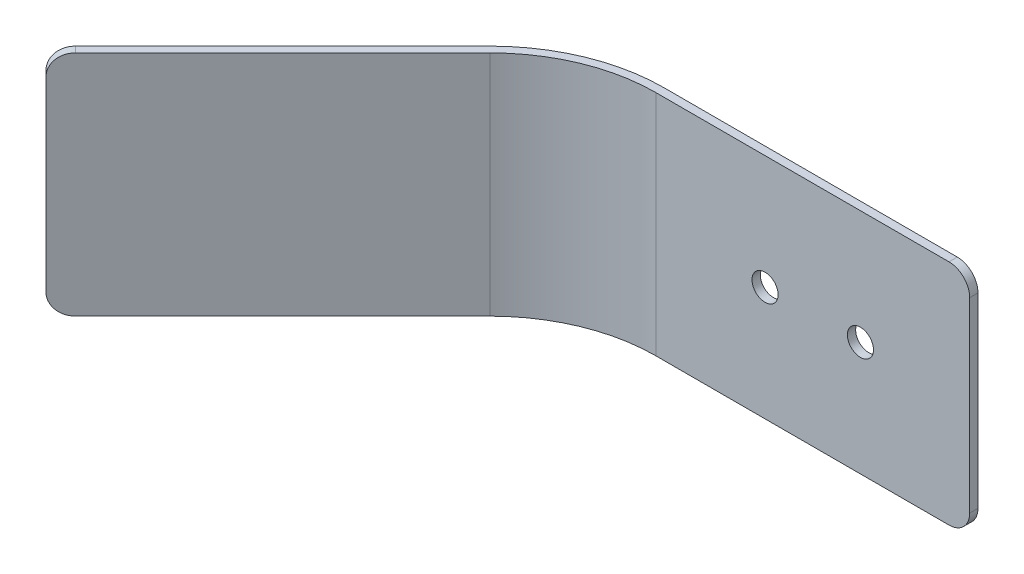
ISO-10303-21;
HEADER;
FILE_DESCRIPTION(('STEP AP214'),'2;1');
FILE_NAME('part.step','',(''),(''),'','','');
FILE_SCHEMA(('AUTOMOTIVE_DESIGN { 1 0 10303 214 1 1 1 1 }'));
ENDSEC;
DATA;
#1=APPLICATION_CONTEXT('core data for automotive mechanical design processes');
#2=APPLICATION_PROTOCOL_DEFINITION('international standard','automotive_design',2000,#1);
#3=PRODUCT_CONTEXT('',#1,'mechanical');
#4=PRODUCT('Part','Part','',(#3));
#5=PRODUCT_RELATED_PRODUCT_CATEGORY('part','',(#4));
#6=PRODUCT_DEFINITION_FORMATION('','',#4);
#7=PRODUCT_DEFINITION_CONTEXT('part definition',#1,'design');
#8=PRODUCT_DEFINITION('design','',#6,#7);
#9=PRODUCT_DEFINITION_SHAPE('','',#8);
#10=(LENGTH_UNIT() NAMED_UNIT(*) SI_UNIT(.MILLI.,.METRE.));
#11=(NAMED_UNIT(*) PLANE_ANGLE_UNIT() SI_UNIT($,.RADIAN.));
#12=(NAMED_UNIT(*) SI_UNIT($,.STERADIAN.) SOLID_ANGLE_UNIT());
#13=UNCERTAINTY_MEASURE_WITH_UNIT(LENGTH_MEASURE(1.E-05),#10,'distance_accuracy_value','');
#14=(GEOMETRIC_REPRESENTATION_CONTEXT(3) GLOBAL_UNCERTAINTY_ASSIGNED_CONTEXT((#13)) GLOBAL_UNIT_ASSIGNED_CONTEXT((#10,
#11,#12)) REPRESENTATION_CONTEXT('',''));
#15=CARTESIAN_POINT('',(0.,0.,0.));
#16=DIRECTION('',(0.,0.,1.));
#17=DIRECTION('',(1.,0.,0.));
#18=AXIS2_PLACEMENT_3D('',#15,#16,#17);
#19=CARTESIAN_POINT('',(0.,0.,0.));
#20=DIRECTION('',(0.707106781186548,0.,0.707106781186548));
#21=DIRECTION('',(0.707106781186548,0.,-0.707106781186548));
#22=AXIS2_PLACEMENT_3D('',#19,#20,#21);
#23=PLANE('',#22);
#24=DIRECTION('',(0.,-1.,0.));
#25=VECTOR('',#24,1.);
#26=CARTESIAN_POINT('',(-83.6286351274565,0.,83.6286351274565));
#27=LINE('',#26,#25);
#28=CARTESIAN_POINT('',(-83.6286351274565,63.5,83.6286351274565));
#29=VERTEX_POINT('',#28);
#30=CARTESIAN_POINT('',(-83.6286351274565,6.34999999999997,83.6286351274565));
#31=VERTEX_POINT('',#30);
#32=EDGE_CURVE('E165',#29,#31,#27,.T.);
#33=ORIENTED_EDGE('',*,*,#32,.F.);
#34=CARTESIAN_POINT('',(-79.1385070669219,63.5,79.1385070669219));
#35=DIRECTION('',(0.707106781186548,0.,0.707106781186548));
#36=DIRECTION('',(0.707106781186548,0.,-0.707106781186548));
#37=AXIS2_PLACEMENT_3D('',#34,#35,#36);
#38=CIRCLE('',#37,6.35);
#39=CARTESIAN_POINT('',(-79.1385070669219,69.85,79.1385070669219));
#40=VERTEX_POINT('',#39);
#41=EDGE_CURVE('E163',#29,#40,#38,.F.);
#42=ORIENTED_EDGE('',*,*,#41,.T.);
#43=DIRECTION('',(-0.707106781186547,0.,0.707106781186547));
#44=VECTOR('',#43,1.);
#45=CARTESIAN_POINT('',(0.,69.85,0.));
#46=LINE('',#45,#44);
#47=CARTESIAN_POINT('',(-15.6229242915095,69.85,15.6229242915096));
#48=VERTEX_POINT('',#47);
#49=EDGE_CURVE('E155',#48,#40,#46,.T.);
#50=ORIENTED_EDGE('',*,*,#49,.F.);
#51=DIRECTION('',(0.,-1.,0.));
#52=VECTOR('',#51,1.);
#53=CARTESIAN_POINT('',(-15.6229242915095,69.85,15.6229242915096));
#54=LINE('',#53,#52);
#55=CARTESIAN_POINT('',(-15.6229242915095,0.,15.6229242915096));
#56=VERTEX_POINT('',#55);
#57=EDGE_CURVE('E138',#48,#56,#54,.T.);
#58=ORIENTED_EDGE('',*,*,#57,.T.);
#59=DIRECTION('',(0.707106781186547,0.,-0.707106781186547));
#60=VECTOR('',#59,1.);
#61=CARTESIAN_POINT('',(0.,0.,0.));
#62=LINE('',#61,#60);
#63=CARTESIAN_POINT('',(-79.1385070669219,0.,79.1385070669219));
#64=VERTEX_POINT('',#63);
#65=EDGE_CURVE('E170',#64,#56,#62,.T.);
#66=ORIENTED_EDGE('',*,*,#65,.F.);
#67=CARTESIAN_POINT('',(-79.1385070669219,6.34999999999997,79.1385070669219));
#68=DIRECTION('',(0.707106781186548,0.,0.707106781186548));
#69=DIRECTION('',(0.707106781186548,0.,-0.707106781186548));
#70=AXIS2_PLACEMENT_3D('',#67,#68,#69);
#71=CIRCLE('',#70,6.35);
#72=EDGE_CURVE('E233',#64,#31,#71,.F.);
#73=ORIENTED_EDGE('',*,*,#72,.T.);
#74=EDGE_LOOP('',(#33,#42,#50,#58,#66,#73));
#75=FACE_BOUND('',#74,.T.);
#76=ADVANCED_FACE('F47',(#75),#23,.F.);
#77=CARTESIAN_POINT('',(0.,0.,0.));
#78=DIRECTION('',(0.,0.,-1.));
#79=DIRECTION('',(-1.,0.,0.));
#80=AXIS2_PLACEMENT_3D('',#77,#78,#79);
#81=PLANE('',#80);
#82=CARTESIAN_POINT('',(55.5764507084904,34.925,0.));
#83=DIRECTION('',(0.,0.,1.));
#84=DIRECTION('',(1.,0.,0.));
#85=AXIS2_PLACEMENT_3D('',#82,#83,#84);
#86=CIRCLE('',#85,4.00000000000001);
#87=CARTESIAN_POINT('',(59.5764507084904,34.925,0.));
#88=VERTEX_POINT('',#87);
#89=EDGE_CURVE('E280',#88,#88,#86,.T.);
#90=ORIENTED_EDGE('',*,*,#89,.T.);
#91=EDGE_LOOP('',(#90));
#92=FACE_BOUND('',#91,.T.);
#93=CARTESIAN_POINT('',(84.7864507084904,34.925,0.));
#94=DIRECTION('',(0.,0.,1.));
#95=DIRECTION('',(1.,0.,0.));
#96=AXIS2_PLACEMENT_3D('',#93,#94,#95);
#97=CIRCLE('',#96,4.00000000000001);
#98=CARTESIAN_POINT('',(88.7864507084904,34.925,0.));
#99=VERTEX_POINT('',#98);
#100=EDGE_CURVE('E282',#99,#99,#97,.T.);
#101=ORIENTED_EDGE('',*,*,#100,.T.);
#102=EDGE_LOOP('',(#101));
#103=FACE_BOUND('',#102,.T.);
#104=DIRECTION('',(0.,1.,0.));
#105=VECTOR('',#104,1.);
#106=CARTESIAN_POINT('',(118.26875,0.,0.));
#107=LINE('',#106,#105);
#108=CARTESIAN_POINT('',(118.26875,6.35000000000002,0.));
#109=VERTEX_POINT('',#108);
#110=CARTESIAN_POINT('',(118.26875,63.5,0.));
#111=VERTEX_POINT('',#110);
#112=EDGE_CURVE('E264',#109,#111,#107,.T.);
#113=ORIENTED_EDGE('',*,*,#112,.F.);
#114=CARTESIAN_POINT('',(111.91875,6.35000000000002,0.));
#115=DIRECTION('',(0.,0.,-1.));
#116=DIRECTION('',(-1.,0.,0.));
#117=AXIS2_PLACEMENT_3D('',#114,#115,#116);
#118=CIRCLE('',#117,6.35);
#119=CARTESIAN_POINT('',(111.91875,0.,0.));
#120=VERTEX_POINT('',#119);
#121=EDGE_CURVE('E205',#109,#120,#118,.T.);
#122=ORIENTED_EDGE('',*,*,#121,.T.);
#123=DIRECTION('',(1.,0.,0.));
#124=VECTOR('',#123,1.);
#125=CARTESIAN_POINT('',(0.,0.,0.));
#126=LINE('',#125,#124);
#127=CARTESIAN_POINT('',(22.0941514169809,0.,0.));
#128=VERTEX_POINT('',#127);
#129=EDGE_CURVE('E268',#128,#120,#126,.T.);
#130=ORIENTED_EDGE('',*,*,#129,.F.);
#131=DIRECTION('',(0.,-1.,0.));
#132=VECTOR('',#131,1.);
#133=CARTESIAN_POINT('',(22.0941514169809,69.85,0.));
#134=LINE('',#133,#132);
#135=CARTESIAN_POINT('',(22.0941514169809,69.85,0.));
#136=VERTEX_POINT('',#135);
#137=EDGE_CURVE('E149',#136,#128,#134,.T.);
#138=ORIENTED_EDGE('',*,*,#137,.F.);
#139=DIRECTION('',(-1.,0.,0.));
#140=VECTOR('',#139,1.);
#141=CARTESIAN_POINT('',(0.,69.85,0.));
#142=LINE('',#141,#140);
#143=CARTESIAN_POINT('',(111.91875,69.85,0.));
#144=VERTEX_POINT('',#143);
#145=EDGE_CURVE('E159',#144,#136,#142,.T.);
#146=ORIENTED_EDGE('',*,*,#145,.F.);
#147=CARTESIAN_POINT('',(111.91875,63.5,0.));
#148=DIRECTION('',(0.,0.,-1.));
#149=DIRECTION('',(-1.,0.,0.));
#150=AXIS2_PLACEMENT_3D('',#147,#148,#149);
#151=CIRCLE('',#150,6.35);
#152=EDGE_CURVE('E202',#144,#111,#151,.T.);
#153=ORIENTED_EDGE('',*,*,#152,.T.);
#154=EDGE_LOOP('',(#113,#122,#130,#138,#146,#153));
#155=FACE_BOUND('',#154,.T.);
#156=ADVANCED_FACE('F298',(#92,#103,#155),#81,.T.);
#157=CARTESIAN_POINT('',(22.0941514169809,0.,53.34));
#158=DIRECTION('',(0.,1.,0.));
#159=DIRECTION('',(0.,0.,1.));
#160=AXIS2_PLACEMENT_3D('',#157,#158,#159);
#161=CYLINDRICAL_SURFACE('',#160,50.8);
#162=DIRECTION('',(0.,1.,0.));
#163=VECTOR('',#162,1.);
#164=CARTESIAN_POINT('',(-13.8268730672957,0.,17.4189755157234));
#165=LINE('',#164,#163);
#166=CARTESIAN_POINT('',(-13.8268730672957,0.,17.4189755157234));
#167=VERTEX_POINT('',#166);
#168=CARTESIAN_POINT('',(-13.8268730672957,69.85,17.4189755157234));
#169=VERTEX_POINT('',#168);
#170=EDGE_CURVE('E181',#167,#169,#165,.T.);
#171=ORIENTED_EDGE('',*,*,#170,.F.);
#172=CARTESIAN_POINT('',(22.0941514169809,0.,53.34));
#173=DIRECTION('',(0.,1.,0.));
#174=DIRECTION('',(0.,0.,1.));
#175=AXIS2_PLACEMENT_3D('',#172,#173,#174);
#176=CIRCLE('',#175,50.8);
#177=CARTESIAN_POINT('',(22.0941514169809,0.,2.54));
#178=VERTEX_POINT('',#177);
#179=EDGE_CURVE('E189',#167,#178,#176,.F.);
#180=ORIENTED_EDGE('',*,*,#179,.T.);
#181=DIRECTION('',(0.,1.,0.));
#182=VECTOR('',#181,1.);
#183=CARTESIAN_POINT('',(22.0941514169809,0.,2.54));
#184=LINE('',#183,#182);
#185=CARTESIAN_POINT('',(22.0941514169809,69.85,2.54));
#186=VERTEX_POINT('',#185);
#187=EDGE_CURVE('E185',#186,#178,#184,.F.);
#188=ORIENTED_EDGE('',*,*,#187,.F.);
#189=CARTESIAN_POINT('',(22.0941514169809,69.85,53.34));
#190=DIRECTION('',(0.,-1.,0.));
#191=DIRECTION('',(0.,0.,-1.));
#192=AXIS2_PLACEMENT_3D('',#189,#190,#191);
#193=CIRCLE('',#192,50.8);
#194=EDGE_CURVE('E192',#186,#169,#193,.F.);
#195=ORIENTED_EDGE('',*,*,#194,.T.);
#196=EDGE_LOOP('',(#171,#180,#188,#195));
#197=FACE_BOUND('',#196,.T.);
#198=ADVANCED_FACE('F332',(#197),#161,.F.);
#199=CARTESIAN_POINT('',(1.79605122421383,0.,1.79605122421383));
#200=DIRECTION('',(0.707106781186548,0.,0.707106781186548));
#201=DIRECTION('',(0.707106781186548,0.,-0.707106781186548));
#202=AXIS2_PLACEMENT_3D('',#199,#200,#201);
#203=PLANE('',#202);
#204=DIRECTION('',(-0.707106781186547,0.,0.707106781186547));
#205=VECTOR('',#204,1.);
#206=CARTESIAN_POINT('',(1.79605122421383,69.85,1.79605122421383));
#207=LINE('',#206,#205);
#208=CARTESIAN_POINT('',(-77.3424558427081,69.85,80.9345582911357));
#209=VERTEX_POINT('',#208);
#210=EDGE_CURVE('E180',#169,#209,#207,.T.);
#211=ORIENTED_EDGE('',*,*,#210,.T.);
#212=CARTESIAN_POINT('',(-77.3424558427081,63.5,80.9345582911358));
#213=DIRECTION('',(0.707106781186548,0.,0.707106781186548));
#214=DIRECTION('',(0.707106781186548,0.,-0.707106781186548));
#215=AXIS2_PLACEMENT_3D('',#212,#213,#214);
#216=CIRCLE('',#215,6.35);
#217=CARTESIAN_POINT('',(-81.8325839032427,63.5,85.4246863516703));
#218=VERTEX_POINT('',#217);
#219=EDGE_CURVE('E11',#209,#218,#216,.T.);
#220=ORIENTED_EDGE('',*,*,#219,.T.);
#221=DIRECTION('',(0.,-1.,0.));
#222=VECTOR('',#221,1.);
#223=CARTESIAN_POINT('',(-81.8325839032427,0.,85.4246863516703));
#224=LINE('',#223,#222);
#225=CARTESIAN_POINT('',(-81.8325839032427,6.34999999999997,85.4246863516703));
#226=VERTEX_POINT('',#225);
#227=EDGE_CURVE('E242',#218,#226,#224,.T.);
#228=ORIENTED_EDGE('',*,*,#227,.T.);
#229=CARTESIAN_POINT('',(-77.3424558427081,6.34999999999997,80.9345582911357));
#230=DIRECTION('',(0.707106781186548,0.,0.707106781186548));
#231=DIRECTION('',(0.707106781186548,0.,-0.707106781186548));
#232=AXIS2_PLACEMENT_3D('',#229,#230,#231);
#233=CIRCLE('',#232,6.35);
#234=CARTESIAN_POINT('',(-77.3424558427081,0.,80.9345582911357));
#235=VERTEX_POINT('',#234);
#236=EDGE_CURVE('E56',#226,#235,#233,.T.);
#237=ORIENTED_EDGE('',*,*,#236,.T.);
#238=DIRECTION('',(0.707106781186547,0.,-0.707106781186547));
#239=VECTOR('',#238,1.);
#240=CARTESIAN_POINT('',(1.79605122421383,0.,1.79605122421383));
#241=LINE('',#240,#239);
#242=EDGE_CURVE('E175',#235,#167,#241,.T.);
#243=ORIENTED_EDGE('',*,*,#242,.T.);
#244=ORIENTED_EDGE('',*,*,#170,.T.);
#245=EDGE_LOOP('',(#211,#220,#228,#237,#243,#244));
#246=FACE_BOUND('',#245,.T.);
#247=ADVANCED_FACE('F240',(#246),#203,.T.);
#248=CARTESIAN_POINT('',(1.79605122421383,69.85,1.79605122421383));
#249=DIRECTION('',(0.,-1.,0.));
#250=DIRECTION('',(0.,0.,-1.));
#251=AXIS2_PLACEMENT_3D('',#248,#249,#250);
#252=PLANE('',#251);
#253=DIRECTION('',(-1.,0.,0.));
#254=VECTOR('',#253,1.);
#255=CARTESIAN_POINT('',(0.,69.85,2.54));
#256=LINE('',#255,#254);
#257=CARTESIAN_POINT('',(111.91875,69.85,2.54));
#258=VERTEX_POINT('',#257);
#259=EDGE_CURVE('E166',#258,#186,#256,.T.);
#260=ORIENTED_EDGE('',*,*,#259,.F.);
#261=DIRECTION('',(0.,0.,-1.));
#262=VECTOR('',#261,1.);
#263=CARTESIAN_POINT('',(111.91875,69.85,1.79605122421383));
#264=LINE('',#263,#262);
#265=EDGE_CURVE('E224',#258,#144,#264,.T.);
#266=ORIENTED_EDGE('',*,*,#265,.T.);
#267=ORIENTED_EDGE('',*,*,#145,.T.);
#268=CARTESIAN_POINT('',(22.0941514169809,69.85,53.34));
#269=DIRECTION('',(0.,1.,0.));
#270=DIRECTION('',(0.,0.,1.));
#271=AXIS2_PLACEMENT_3D('',#268,#269,#270);
#272=CIRCLE('',#271,53.34);
#273=EDGE_CURVE('E141',#136,#48,#272,.T.);
#274=ORIENTED_EDGE('',*,*,#273,.T.);
#275=ORIENTED_EDGE('',*,*,#49,.T.);
#276=DIRECTION('',(-0.707106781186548,0.,-0.707106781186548));
#277=VECTOR('',#276,1.);
#278=CARTESIAN_POINT('',(-77.3424558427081,69.85,80.9345582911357));
#279=LINE('',#278,#277);
#280=EDGE_CURVE('E221',#40,#209,#279,.F.);
#281=ORIENTED_EDGE('',*,*,#280,.T.);
#282=ORIENTED_EDGE('',*,*,#210,.F.);
#283=ORIENTED_EDGE('',*,*,#194,.F.);
#284=EDGE_LOOP('',(#260,#266,#267,#274,#275,#281,#282,#283));
#285=FACE_BOUND('',#284,.T.);
#286=ADVANCED_FACE('F154',(#285),#252,.F.);
#287=CARTESIAN_POINT('',(-81.8325839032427,0.,85.4246863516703));
#288=DIRECTION('',(0.707106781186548,0.,-0.707106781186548));
#289=DIRECTION('',(-0.707106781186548,0.,-0.707106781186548));
#290=AXIS2_PLACEMENT_3D('',#287,#288,#289);
#291=PLANE('',#290);
#292=ORIENTED_EDGE('',*,*,#227,.F.);
#293=DIRECTION('',(-0.707106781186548,0.,-0.707106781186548));
#294=VECTOR('',#293,1.);
#295=CARTESIAN_POINT('',(-81.8325839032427,63.5,85.4246863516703));
#296=LINE('',#295,#294);
#297=EDGE_CURVE('E229',#218,#29,#296,.T.);
#298=ORIENTED_EDGE('',*,*,#297,.T.);
#299=ORIENTED_EDGE('',*,*,#32,.T.);
#300=DIRECTION('',(-0.707106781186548,0.,-0.707106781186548));
#301=VECTOR('',#300,1.);
#302=CARTESIAN_POINT('',(-81.8325839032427,6.34999999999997,85.4246863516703));
#303=LINE('',#302,#301);
#304=EDGE_CURVE('E63',#31,#226,#303,.F.);
#305=ORIENTED_EDGE('',*,*,#304,.T.);
#306=EDGE_LOOP('',(#292,#298,#299,#305));
#307=FACE_BOUND('',#306,.T.);
#308=ADVANCED_FACE('F251',(#307),#291,.F.);
#309=CARTESIAN_POINT('',(1.79605122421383,0.,1.79605122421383));
#310=DIRECTION('',(0.,1.,0.));
#311=DIRECTION('',(0.,0.,1.));
#312=AXIS2_PLACEMENT_3D('',#309,#310,#311);
#313=PLANE('',#312);
#314=ORIENTED_EDGE('',*,*,#129,.T.);
#315=DIRECTION('',(0.,0.,-1.));
#316=VECTOR('',#315,1.);
#317=CARTESIAN_POINT('',(111.91875,0.,1.79605122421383));
#318=LINE('',#317,#316);
#319=CARTESIAN_POINT('',(111.91875,0.,2.54));
#320=VERTEX_POINT('',#319);
#321=EDGE_CURVE('E212',#120,#320,#318,.F.);
#322=ORIENTED_EDGE('',*,*,#321,.T.);
#323=DIRECTION('',(1.,0.,0.));
#324=VECTOR('',#323,1.);
#325=CARTESIAN_POINT('',(0.,0.,2.54));
#326=LINE('',#325,#324);
#327=EDGE_CURVE('E263',#178,#320,#326,.T.);
#328=ORIENTED_EDGE('',*,*,#327,.F.);
#329=ORIENTED_EDGE('',*,*,#179,.F.);
#330=ORIENTED_EDGE('',*,*,#242,.F.);
#331=DIRECTION('',(-0.707106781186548,0.,-0.707106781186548));
#332=VECTOR('',#331,1.);
#333=CARTESIAN_POINT('',(-77.3424558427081,0.,80.9345582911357));
#334=LINE('',#333,#332);
#335=EDGE_CURVE('E208',#235,#64,#334,.T.);
#336=ORIENTED_EDGE('',*,*,#335,.T.);
#337=ORIENTED_EDGE('',*,*,#65,.T.);
#338=CARTESIAN_POINT('',(22.0941514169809,0.,53.34));
#339=DIRECTION('',(0.,1.,0.));
#340=DIRECTION('',(0.,0.,1.));
#341=AXIS2_PLACEMENT_3D('',#338,#339,#340);
#342=CIRCLE('',#341,53.34);
#343=EDGE_CURVE('E144',#128,#56,#342,.T.);
#344=ORIENTED_EDGE('',*,*,#343,.F.);
#345=EDGE_LOOP('',(#314,#322,#328,#329,#330,#336,#337,#344));
#346=FACE_BOUND('',#345,.T.);
#347=ADVANCED_FACE('F247',(#346),#313,.F.);
#348=CARTESIAN_POINT('',(118.26875,0.,2.54));
#349=DIRECTION('',(-1.,0.,0.));
#350=DIRECTION('',(0.,0.,1.));
#351=AXIS2_PLACEMENT_3D('',#348,#349,#350);
#352=PLANE('',#351);
#353=DIRECTION('',(0.,1.,0.));
#354=VECTOR('',#353,1.);
#355=CARTESIAN_POINT('',(118.26875,0.,2.54));
#356=LINE('',#355,#354);
#357=CARTESIAN_POINT('',(118.26875,6.35000000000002,2.54));
#358=VERTEX_POINT('',#357);
#359=CARTESIAN_POINT('',(118.26875,63.5,2.54));
#360=VERTEX_POINT('',#359);
#361=EDGE_CURVE('E172',#358,#360,#356,.T.);
#362=ORIENTED_EDGE('',*,*,#361,.F.);
#363=DIRECTION('',(0.,0.,-1.));
#364=VECTOR('',#363,1.);
#365=CARTESIAN_POINT('',(118.26875,6.35000000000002,2.54));
#366=LINE('',#365,#364);
#367=EDGE_CURVE('E198',#358,#109,#366,.T.);
#368=ORIENTED_EDGE('',*,*,#367,.T.);
#369=ORIENTED_EDGE('',*,*,#112,.T.);
#370=DIRECTION('',(0.,0.,-1.));
#371=VECTOR('',#370,1.);
#372=CARTESIAN_POINT('',(118.26875,63.5,2.54));
#373=LINE('',#372,#371);
#374=EDGE_CURVE('E195',#111,#360,#373,.F.);
#375=ORIENTED_EDGE('',*,*,#374,.T.);
#376=EDGE_LOOP('',(#362,#368,#369,#375));
#377=FACE_BOUND('',#376,.T.);
#378=ADVANCED_FACE('F311',(#377),#352,.F.);
#379=CARTESIAN_POINT('',(0.,0.,2.54));
#380=DIRECTION('',(0.,0.,-1.));
#381=DIRECTION('',(-1.,0.,0.));
#382=AXIS2_PLACEMENT_3D('',#379,#380,#381);
#383=PLANE('',#382);
#384=CARTESIAN_POINT('',(55.5764507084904,34.925,2.54));
#385=DIRECTION('',(0.,0.,1.));
#386=DIRECTION('',(1.,0.,0.));
#387=AXIS2_PLACEMENT_3D('',#384,#385,#386);
#388=CIRCLE('',#387,4.00000000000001);
#389=CARTESIAN_POINT('',(59.5764507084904,34.925,2.54));
#390=VERTEX_POINT('',#389);
#391=EDGE_CURVE('E290',#390,#390,#388,.T.);
#392=ORIENTED_EDGE('',*,*,#391,.F.);
#393=EDGE_LOOP('',(#392));
#394=FACE_BOUND('',#393,.T.);
#395=CARTESIAN_POINT('',(84.7864507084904,34.925,2.54));
#396=DIRECTION('',(0.,0.,1.));
#397=DIRECTION('',(1.,0.,0.));
#398=AXIS2_PLACEMENT_3D('',#395,#396,#397);
#399=CIRCLE('',#398,4.00000000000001);
#400=CARTESIAN_POINT('',(88.7864507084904,34.925,2.54));
#401=VERTEX_POINT('',#400);
#402=EDGE_CURVE('E286',#401,#401,#399,.T.);
#403=ORIENTED_EDGE('',*,*,#402,.F.);
#404=EDGE_LOOP('',(#403));
#405=FACE_BOUND('',#404,.T.);
#406=ORIENTED_EDGE('',*,*,#327,.T.);
#407=CARTESIAN_POINT('',(111.91875,6.35000000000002,2.54));
#408=DIRECTION('',(0.,0.,-1.));
#409=DIRECTION('',(-1.,0.,0.));
#410=AXIS2_PLACEMENT_3D('',#407,#408,#409);
#411=CIRCLE('',#410,6.35);
#412=EDGE_CURVE('E218',#320,#358,#411,.F.);
#413=ORIENTED_EDGE('',*,*,#412,.T.);
#414=ORIENTED_EDGE('',*,*,#361,.T.);
#415=CARTESIAN_POINT('',(111.91875,63.5,2.54));
#416=DIRECTION('',(0.,0.,-1.));
#417=DIRECTION('',(-1.,0.,0.));
#418=AXIS2_PLACEMENT_3D('',#415,#416,#417);
#419=CIRCLE('',#418,6.35);
#420=EDGE_CURVE('E215',#360,#258,#419,.F.);
#421=ORIENTED_EDGE('',*,*,#420,.T.);
#422=ORIENTED_EDGE('',*,*,#259,.T.);
#423=ORIENTED_EDGE('',*,*,#187,.T.);
#424=EDGE_LOOP('',(#406,#413,#414,#421,#422,#423));
#425=FACE_BOUND('',#424,.T.);
#426=ADVANCED_FACE('F308',(#394,#405,#425),#383,.F.);
#427=CARTESIAN_POINT('',(22.0941514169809,69.85,53.34));
#428=DIRECTION('',(0.,-1.,0.));
#429=DIRECTION('',(0.,0.,-1.));
#430=AXIS2_PLACEMENT_3D('',#427,#428,#429);
#431=CYLINDRICAL_SURFACE('',#430,53.34);
#432=ORIENTED_EDGE('',*,*,#343,.T.);
#433=ORIENTED_EDGE('',*,*,#57,.F.);
#434=ORIENTED_EDGE('',*,*,#273,.F.);
#435=ORIENTED_EDGE('',*,*,#137,.T.);
#436=EDGE_LOOP('',(#432,#433,#434,#435));
#437=FACE_BOUND('',#436,.T.);
#438=ADVANCED_FACE('F140',(#437),#431,.T.);
#439=CARTESIAN_POINT('',(111.91875,6.35000000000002,2.54));
#440=DIRECTION('',(0.,0.,-1.));
#441=DIRECTION('',(0.,1.,0.));
#442=AXIS2_PLACEMENT_3D('',#439,#440,#441);
#443=CYLINDRICAL_SURFACE('',#442,6.35);
#444=ORIENTED_EDGE('',*,*,#412,.F.);
#445=ORIENTED_EDGE('',*,*,#321,.F.);
#446=ORIENTED_EDGE('',*,*,#121,.F.);
#447=ORIENTED_EDGE('',*,*,#367,.F.);
#448=EDGE_LOOP('',(#444,#445,#446,#447));
#449=FACE_BOUND('',#448,.T.);
#450=ADVANCED_FACE('F321',(#449),#443,.T.);
#451=CARTESIAN_POINT('',(111.91875,63.5,1.79605122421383));
#452=DIRECTION('',(0.,0.,-1.));
#453=DIRECTION('',(0.,1.,0.));
#454=AXIS2_PLACEMENT_3D('',#451,#452,#453);
#455=CYLINDRICAL_SURFACE('',#454,6.35);
#456=ORIENTED_EDGE('',*,*,#420,.F.);
#457=ORIENTED_EDGE('',*,*,#374,.F.);
#458=ORIENTED_EDGE('',*,*,#152,.F.);
#459=ORIENTED_EDGE('',*,*,#265,.F.);
#460=EDGE_LOOP('',(#456,#457,#458,#459));
#461=FACE_BOUND('',#460,.T.);
#462=ADVANCED_FACE('F330',(#461),#455,.T.);
#463=CARTESIAN_POINT('',(-77.3424558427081,63.5,80.9345582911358));
#464=DIRECTION('',(-0.707106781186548,0.,-0.707106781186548));
#465=DIRECTION('',(-0.707106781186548,0.,0.707106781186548));
#466=AXIS2_PLACEMENT_3D('',#463,#464,#465);
#467=CYLINDRICAL_SURFACE('',#466,6.35);
#468=ORIENTED_EDGE('',*,*,#219,.F.);
#469=ORIENTED_EDGE('',*,*,#280,.F.);
#470=ORIENTED_EDGE('',*,*,#41,.F.);
#471=ORIENTED_EDGE('',*,*,#297,.F.);
#472=EDGE_LOOP('',(#468,#469,#470,#471));
#473=FACE_BOUND('',#472,.T.);
#474=ADVANCED_FACE('F254',(#473),#467,.T.);
#475=CARTESIAN_POINT('',(-77.3424558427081,6.34999999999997,80.9345582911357));
#476=DIRECTION('',(-0.707106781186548,0.,-0.707106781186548));
#477=DIRECTION('',(-0.707106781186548,0.,0.707106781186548));
#478=AXIS2_PLACEMENT_3D('',#475,#476,#477);
#479=CYLINDRICAL_SURFACE('',#478,6.35);
#480=ORIENTED_EDGE('',*,*,#236,.F.);
#481=ORIENTED_EDGE('',*,*,#304,.F.);
#482=ORIENTED_EDGE('',*,*,#72,.F.);
#483=ORIENTED_EDGE('',*,*,#335,.F.);
#484=EDGE_LOOP('',(#480,#481,#482,#483));
#485=FACE_BOUND('',#484,.T.);
#486=ADVANCED_FACE('F49',(#485),#479,.T.);
#487=CARTESIAN_POINT('',(84.7864507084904,34.925,0.));
#488=DIRECTION('',(0.,0.,1.));
#489=DIRECTION('',(1.,0.,0.));
#490=AXIS2_PLACEMENT_3D('',#487,#488,#489);
#491=CYLINDRICAL_SURFACE('',#490,4.00000000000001);
#492=ORIENTED_EDGE('',*,*,#100,.F.);
#493=EDGE_LOOP('',(#492));
#494=FACE_BOUND('',#493,.T.);
#495=ORIENTED_EDGE('',*,*,#402,.T.);
#496=EDGE_LOOP('',(#495));
#497=FACE_BOUND('',#496,.T.);
#498=ADVANCED_FACE('F304',(#494,#497),#491,.F.);
#499=CARTESIAN_POINT('',(55.5764507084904,34.925,0.));
#500=DIRECTION('',(0.,0.,1.));
#501=DIRECTION('',(1.,0.,0.));
#502=AXIS2_PLACEMENT_3D('',#499,#500,#501);
#503=CYLINDRICAL_SURFACE('',#502,4.00000000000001);
#504=ORIENTED_EDGE('',*,*,#89,.F.);
#505=EDGE_LOOP('',(#504));
#506=FACE_BOUND('',#505,.T.);
#507=ORIENTED_EDGE('',*,*,#391,.T.);
#508=EDGE_LOOP('',(#507));
#509=FACE_BOUND('',#508,.T.);
#510=ADVANCED_FACE('F301',(#506,#509),#503,.F.);
#511=CLOSED_SHELL('',(#76,#156,#198,#247,#286,#308,#347,#378,#426,#438,#450,#462,#474,#486,#498,#510));
#512=MANIFOLD_SOLID_BREP('B2',#511);
#513=ADVANCED_BREP_SHAPE_REPRESENTATION('',(#18,#512),#14);
#514=SHAPE_DEFINITION_REPRESENTATION(#9,#513);
ENDSEC;
END-ISO-10303-21;
